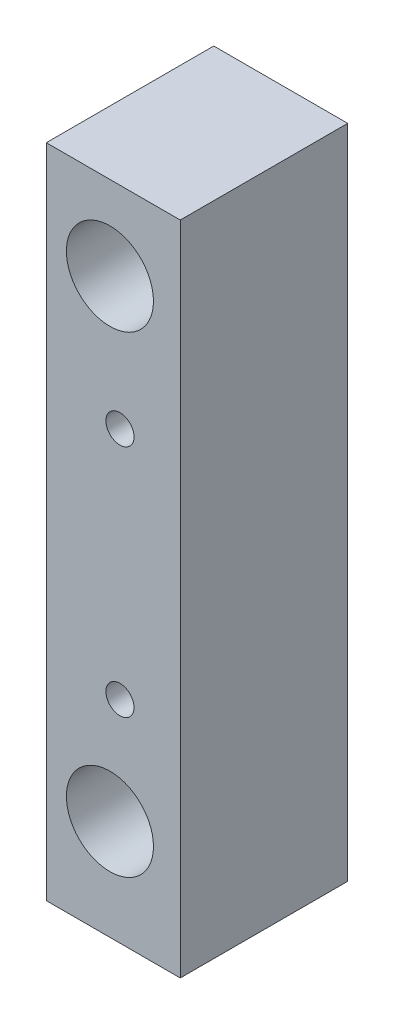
from build123d import *

# Parameters (mm, degrees)
ESQUISSE1_W             = 40
ESQUISSE1_H             = 196
EXTRUSION1_DEPTH        = 50
D_GAGEMENT_M81_D        = 8.4
ESQUISSE6_R             = 13
ENL_V_MAT_EXTRU_1_DEPTH = 207.194083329


with BuildPart() as part:
    # Esquisse1 → Extrusion1 (new body)
    with BuildSketch(Plane.XY):
        with Locations((20, 98)):
            Rectangle(ESQUISSE1_W, ESQUISSE1_H)
    extrude(amount=EXTRUSION1_DEPTH)

    # D_gagement M81 (through all)
    with Locations(Plane.XY.offset(50)):
        with Locations((22, 133), (22, 63)):
            Hole(D_GAGEMENT_M81_D / 2)

    # Esquisse6 → Enl_v. mat.-Extru.1 (cut, through all)
    with BuildSketch(Plane.XY.offset(50)):
        with Locations((19, 171)):
            Circle(ESQUISSE6_R)
        with Locations((19, 30)):
            Circle(ESQUISSE6_R)
    extrude(amount=-ENL_V_MAT_EXTRU_1_DEPTH, mode=Mode.SUBTRACT)


solid = part.part
